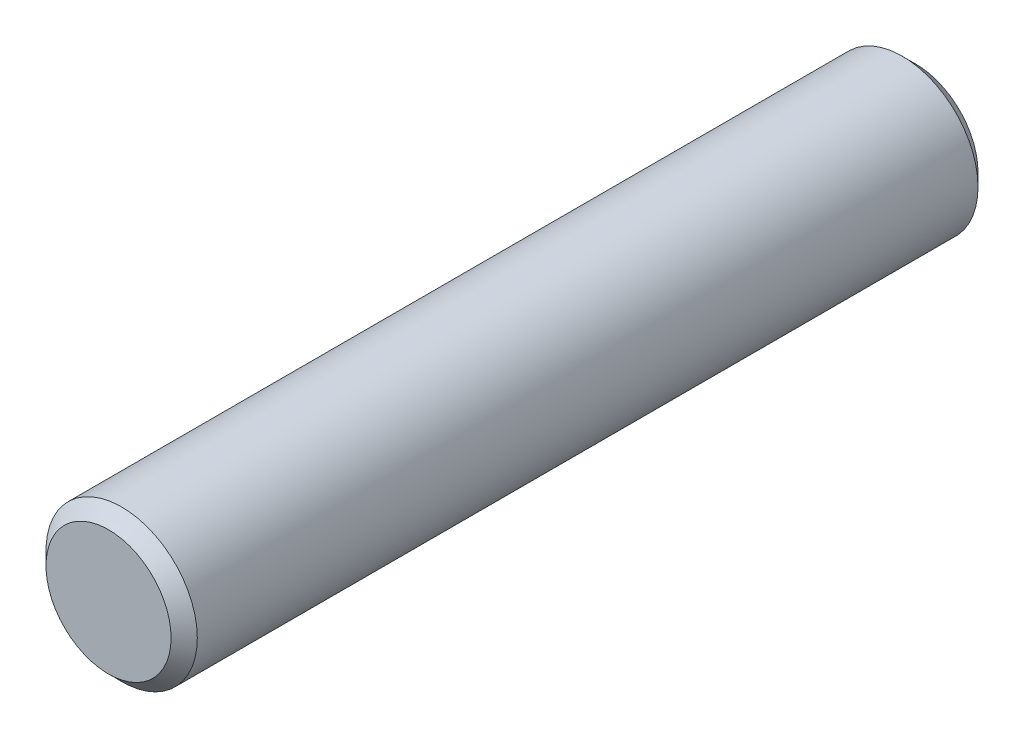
ISO-10303-21;
HEADER;
FILE_DESCRIPTION(('STEP AP214'),'2;1');
FILE_NAME('part.step','',(''),(''),'','','');
FILE_SCHEMA(('AUTOMOTIVE_DESIGN { 1 0 10303 214 1 1 1 1 }'));
ENDSEC;
DATA;
#1=APPLICATION_CONTEXT('core data for automotive mechanical design processes');
#2=APPLICATION_PROTOCOL_DEFINITION('international standard','automotive_design',2000,#1);
#3=PRODUCT_CONTEXT('',#1,'mechanical');
#4=PRODUCT('Part','Part','',(#3));
#5=PRODUCT_RELATED_PRODUCT_CATEGORY('part','',(#4));
#6=PRODUCT_DEFINITION_FORMATION('','',#4);
#7=PRODUCT_DEFINITION_CONTEXT('part definition',#1,'design');
#8=PRODUCT_DEFINITION('design','',#6,#7);
#9=PRODUCT_DEFINITION_SHAPE('','',#8);
#10=(LENGTH_UNIT() NAMED_UNIT(*) SI_UNIT(.MILLI.,.METRE.));
#11=(NAMED_UNIT(*) PLANE_ANGLE_UNIT() SI_UNIT($,.RADIAN.));
#12=(NAMED_UNIT(*) SI_UNIT($,.STERADIAN.) SOLID_ANGLE_UNIT());
#13=UNCERTAINTY_MEASURE_WITH_UNIT(LENGTH_MEASURE(1.E-05),#10,'distance_accuracy_value','');
#14=(GEOMETRIC_REPRESENTATION_CONTEXT(3) GLOBAL_UNCERTAINTY_ASSIGNED_CONTEXT((#13)) GLOBAL_UNIT_ASSIGNED_CONTEXT((#10,
#11,#12)) REPRESENTATION_CONTEXT('',''));
#15=CARTESIAN_POINT('',(0.,0.,0.));
#16=DIRECTION('',(0.,0.,1.));
#17=DIRECTION('',(1.,0.,0.));
#18=AXIS2_PLACEMENT_3D('',#15,#16,#17);
#19=CARTESIAN_POINT('',(0.,0.,25.4));
#20=DIRECTION('',(0.,0.,-1.));
#21=DIRECTION('',(-1.,0.,0.));
#22=AXIS2_PLACEMENT_3D('',#19,#20,#21);
#23=CYLINDRICAL_SURFACE('',#22,4.7625);
#24=CARTESIAN_POINT('',(0.,0.,-24.5745));
#25=DIRECTION('',(0.,0.,1.));
#26=DIRECTION('',(1.,0.,0.));
#27=AXIS2_PLACEMENT_3D('',#24,#25,#26);
#28=CIRCLE('',#27,4.7625);
#29=CARTESIAN_POINT('',(4.7625,0.,-24.5745));
#30=VERTEX_POINT('',#29);
#31=EDGE_CURVE('E35',#30,#30,#28,.T.);
#32=ORIENTED_EDGE('',*,*,#31,.T.);
#33=EDGE_LOOP('',(#32));
#34=FACE_BOUND('',#33,.T.);
#35=CARTESIAN_POINT('',(0.,0.,24.5745));
#36=DIRECTION('',(0.,0.,1.));
#37=DIRECTION('',(1.,0.,0.));
#38=AXIS2_PLACEMENT_3D('',#35,#36,#37);
#39=CIRCLE('',#38,4.7625);
#40=CARTESIAN_POINT('',(4.7625,0.,24.5745));
#41=VERTEX_POINT('',#40);
#42=EDGE_CURVE('E39',#41,#41,#39,.F.);
#43=ORIENTED_EDGE('',*,*,#42,.T.);
#44=EDGE_LOOP('',(#43));
#45=FACE_BOUND('',#44,.T.);
#46=ADVANCED_FACE('F25',(#34,#45),#23,.T.);
#47=CARTESIAN_POINT('',(0.,0.,25.4));
#48=DIRECTION('',(0.,0.,1.));
#49=DIRECTION('',(1.,0.,0.));
#50=AXIS2_PLACEMENT_3D('',#47,#48,#49);
#51=PLANE('',#50);
#52=CARTESIAN_POINT('',(0.,0.,25.4));
#53=DIRECTION('',(0.,0.,1.));
#54=DIRECTION('',(1.,0.,0.));
#55=AXIS2_PLACEMENT_3D('',#52,#53,#54);
#56=CIRCLE('',#55,3.937);
#57=CARTESIAN_POINT('',(3.937,0.,25.4));
#58=VERTEX_POINT('',#57);
#59=EDGE_CURVE('E10',#58,#58,#56,.T.);
#60=ORIENTED_EDGE('',*,*,#59,.T.);
#61=EDGE_LOOP('',(#60));
#62=FACE_BOUND('',#61,.T.);
#63=ADVANCED_FACE('F58',(#62),#51,.T.);
#64=CARTESIAN_POINT('',(0.,0.,-25.4));
#65=DIRECTION('',(0.,0.,1.));
#66=DIRECTION('',(1.,0.,0.));
#67=AXIS2_PLACEMENT_3D('',#64,#65,#66);
#68=PLANE('',#67);
#69=CARTESIAN_POINT('',(0.,0.,-25.4));
#70=DIRECTION('',(0.,0.,1.));
#71=DIRECTION('',(1.,0.,0.));
#72=AXIS2_PLACEMENT_3D('',#69,#70,#71);
#73=CIRCLE('',#72,3.93700000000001);
#74=CARTESIAN_POINT('',(3.93700000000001,0.,-25.4));
#75=VERTEX_POINT('',#74);
#76=EDGE_CURVE('E31',#75,#75,#73,.F.);
#77=ORIENTED_EDGE('',*,*,#76,.T.);
#78=EDGE_LOOP('',(#77));
#79=FACE_BOUND('',#78,.T.);
#80=ADVANCED_FACE('F54',(#79),#68,.F.);
#81=CARTESIAN_POINT('',(0.,0.,-24.5745));
#82=DIRECTION('',(0.,0.,1.));
#83=DIRECTION('',(1.,0.,0.));
#84=AXIS2_PLACEMENT_3D('',#81,#82,#83);
#85=CONICAL_SURFACE('',#84,4.7625,0.78539816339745);
#86=ORIENTED_EDGE('',*,*,#76,.F.);
#87=EDGE_LOOP('',(#86));
#88=FACE_BOUND('',#87,.T.);
#89=ORIENTED_EDGE('',*,*,#31,.F.);
#90=EDGE_LOOP('',(#89));
#91=FACE_BOUND('',#90,.T.);
#92=ADVANCED_FACE('F49',(#88,#91),#85,.T.);
#93=CARTESIAN_POINT('',(0.,0.,25.4));
#94=DIRECTION('',(0.,0.,-1.));
#95=DIRECTION('',(-1.,0.,0.));
#96=AXIS2_PLACEMENT_3D('',#93,#94,#95);
#97=CONICAL_SURFACE('',#96,3.937,0.785398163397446);
#98=ORIENTED_EDGE('',*,*,#42,.F.);
#99=EDGE_LOOP('',(#98));
#100=FACE_BOUND('',#99,.T.);
#101=ORIENTED_EDGE('',*,*,#59,.F.);
#102=EDGE_LOOP('',(#101));
#103=FACE_BOUND('',#102,.T.);
#104=ADVANCED_FACE('F46',(#100,#103),#97,.T.);
#105=CLOSED_SHELL('',(#46,#63,#80,#92,#104));
#106=MANIFOLD_SOLID_BREP('B2',#105);
#107=ADVANCED_BREP_SHAPE_REPRESENTATION('',(#18,#106),#14);
#108=SHAPE_DEFINITION_REPRESENTATION(#9,#107);
ENDSEC;
END-ISO-10303-21;
